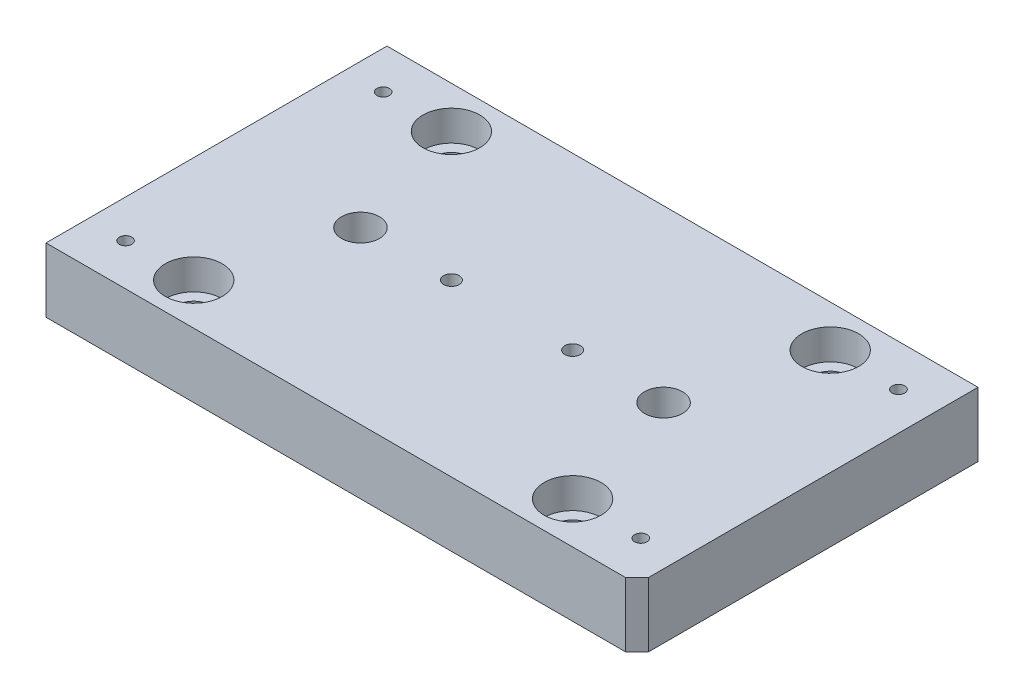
from build123d import *

# Parameters (mm, degrees)
ESQUISSE1_W                                     = 156
ESQUISSE1_H                                     = 90
EXTRUSION1_DEPTH                                = 17
TROU_TARAUD_M4X0_71_D                           = 3.3
TROU_TARAUD_M4X0_71_DEPTH                       = 10.1
TROU_TARAUD_M4X0_71_TIP                         = 0.991420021
CHAMBRAGE_POUR_VIS_T_TE_CYLINDRIQUE_D           = 9
CHAMBRAGE_POUR_VIS_T_TE_CYLINDRIQUE_CBORE_D     = 15
CHAMBRAGE_POUR_VIS_T_TE_CYLINDRIQUE_CBORE_DEPTH = 8
ESQUISSE6_R                                     = 2.05
ENL_V_MAT_EXTRU_1_DEPTH                         = 92.640602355
ESQUISSE8_R                                     = 4.5
ENL_V_MAT_EXTRU_2_DEPTH                         = 8
CHANFREIN_D_SIZE                                = 3
ESQUISSE10_R                                    = 5
ENL_V_MAT_EXTRU_6_DEPTH                         = 92.640602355


with BuildPart() as part:
    # Esquisse1 → Extrusion1 (new body)
    with BuildSketch(Plane(origin=(0, 0, 0), x_dir=(1, 0, 0), z_dir=(0, 1, 0))):
        Rectangle(ESQUISSE1_W, ESQUISSE1_H)
    extrude(amount=EXTRUSION1_DEPTH)

    # Trou taraud_ M4x0.71
    with Locations(Plane(origin=(0, 17, 0), x_dir=(-1, 0, 0), z_dir=(0, 1, 0))):
        with Locations((-68, 34), (-68, -34), (68, -34), (68, 34)):
            Hole(TROU_TARAUD_M4X0_71_D / 2, depth=TROU_TARAUD_M4X0_71_DEPTH)
            with Locations((0, 0, -(TROU_TARAUD_M4X0_71_DEPTH + TROU_TARAUD_M4X0_71_TIP / 2))):  # 118° drill point
                Cone(0, TROU_TARAUD_M4X0_71_D / 2, TROU_TARAUD_M4X0_71_TIP, mode=Mode.SUBTRACT)

    # Chambrage pour vis _ t_te cylindrique (through all)
    with Locations(Plane(origin=(0, 17, 0), x_dir=(-1, 0, 0), z_dir=(0, 1, 0))):
        with Locations((-50, 34), (-50, -34), (50, -34), (50, 34)):
            CounterBoreHole(CHAMBRAGE_POUR_VIS_T_TE_CYLINDRIQUE_D / 2, CHAMBRAGE_POUR_VIS_T_TE_CYLINDRIQUE_CBORE_D / 2, CHAMBRAGE_POUR_VIS_T_TE_CYLINDRIQUE_CBORE_DEPTH)

    # Esquisse6 → Enl_v. mat.-Extru.1 (cut, through all)
    with BuildSketch(Plane(origin=(0, 17, 0), x_dir=(-1, 0, 0), z_dir=(0, 1, 0))):
        with Locations(Location((-16, 0, 0), (0, 0, 90))):
            Circle(ESQUISSE6_R)
        with Locations(Location((16, 0, 0), (0, 0, 90))):
            Circle(ESQUISSE6_R)
    extrude(amount=-ENL_V_MAT_EXTRU_1_DEPTH, mode=Mode.SUBTRACT)

    # Esquisse8 → Enl_v. mat.-Extru.2 (cut)
    with BuildSketch(Plane.XZ):
        with Locations(Location((16, 0, 0), (0, 0, 270))):
            Circle(ESQUISSE8_R)
        with Locations(Location((-16, 0, 0), (0, 0, 270))):
            Circle(ESQUISSE8_R)
    extrude(amount=-ENL_V_MAT_EXTRU_2_DEPTH, mode=Mode.SUBTRACT)

    # Chanfrein_D
    chanfrein_d_edges = [part.edges().sort_by_distance(p)[0] for p in [
        (78, 8.5, 45),
    ]]
    chamfer(chanfrein_d_edges, length=CHANFREIN_D_SIZE)

    # Esquisse10 → Enl_v. mat.-Extru.6 (cut, through all)
    with BuildSketch(Plane.XZ):
        with Locations(Location((40, 0, 0), (0, 0, 270))):
            Circle(ESQUISSE10_R)
        with Locations(Location((-40, 0, 0), (0, 0, 270))):
            Circle(ESQUISSE10_R)
    extrude(amount=-ENL_V_MAT_EXTRU_6_DEPTH, mode=Mode.SUBTRACT)


solid = part.part
